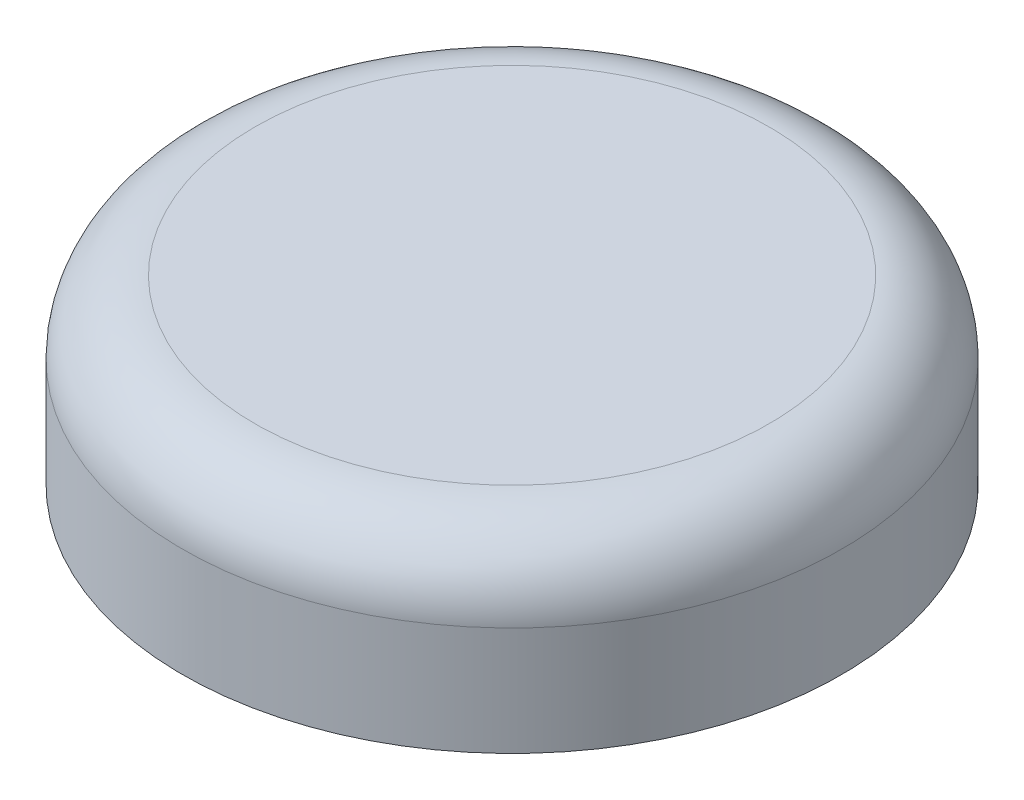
ISO-10303-21;
HEADER;
FILE_DESCRIPTION(('STEP AP214'),'2;1');
FILE_NAME('part.step','',(''),(''),'','','');
FILE_SCHEMA(('AUTOMOTIVE_DESIGN { 1 0 10303 214 1 1 1 1 }'));
ENDSEC;
DATA;
#1=APPLICATION_CONTEXT('core data for automotive mechanical design processes');
#2=APPLICATION_PROTOCOL_DEFINITION('international standard','automotive_design',2000,#1);
#3=PRODUCT_CONTEXT('',#1,'mechanical');
#4=PRODUCT('Part','Part','',(#3));
#5=PRODUCT_RELATED_PRODUCT_CATEGORY('part','',(#4));
#6=PRODUCT_DEFINITION_FORMATION('','',#4);
#7=PRODUCT_DEFINITION_CONTEXT('part definition',#1,'design');
#8=PRODUCT_DEFINITION('design','',#6,#7);
#9=PRODUCT_DEFINITION_SHAPE('','',#8);
#10=(LENGTH_UNIT() NAMED_UNIT(*) SI_UNIT(.MILLI.,.METRE.));
#11=(NAMED_UNIT(*) PLANE_ANGLE_UNIT() SI_UNIT($,.RADIAN.));
#12=(NAMED_UNIT(*) SI_UNIT($,.STERADIAN.) SOLID_ANGLE_UNIT());
#13=UNCERTAINTY_MEASURE_WITH_UNIT(LENGTH_MEASURE(1.E-05),#10,'distance_accuracy_value','');
#14=(GEOMETRIC_REPRESENTATION_CONTEXT(3) GLOBAL_UNCERTAINTY_ASSIGNED_CONTEXT((#13)) GLOBAL_UNIT_ASSIGNED_CONTEXT((#10,
#11,#12)) REPRESENTATION_CONTEXT('',''));
#15=CARTESIAN_POINT('',(0.,0.,0.));
#16=DIRECTION('',(0.,0.,1.));
#17=DIRECTION('',(1.,0.,0.));
#18=AXIS2_PLACEMENT_3D('',#15,#16,#17);
#19=CARTESIAN_POINT('',(-1.,-2.,0.));
#20=DIRECTION('',(0.,-1.,0.));
#21=DIRECTION('',(1.,0.,0.));
#22=AXIS2_PLACEMENT_3D('',#19,#20,#21);
#23=PLANE('',#22);
#24=CARTESIAN_POINT('',(0.,-2.,0.));
#25=DIRECTION('',(0.,1.,0.));
#26=DIRECTION('',(-1.,0.,0.));
#27=AXIS2_PLACEMENT_3D('',#24,#25,#26);
#28=CIRCLE('',#27,1.00000000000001);
#29=CARTESIAN_POINT('',(-1.,-2.,0.));
#30=VERTEX_POINT('',#29);
#31=EDGE_CURVE('E62',#30,#30,#28,.T.);
#32=ORIENTED_EDGE('',*,*,#31,.F.);
#33=EDGE_LOOP('',(#32));
#34=FACE_BOUND('',#33,.T.);
#35=ADVANCED_FACE('F31',(#34),#23,.T.);
#36=CARTESIAN_POINT('',(-7.10000000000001,5.,0.));
#37=DIRECTION('',(0.,1.,0.));
#38=DIRECTION('',(-1.,0.,0.));
#39=AXIS2_PLACEMENT_3D('',#36,#37,#38);
#40=PLANE('',#39);
#41=CARTESIAN_POINT('',(0.,5.00000000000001,0.));
#42=DIRECTION('',(0.,1.,0.));
#43=DIRECTION('',(-1.,0.,0.));
#44=AXIS2_PLACEMENT_3D('',#41,#42,#43);
#45=CIRCLE('',#44,7.1);
#46=CARTESIAN_POINT('',(-7.10000000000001,5.,0.));
#47=VERTEX_POINT('',#46);
#48=EDGE_CURVE('E10',#47,#47,#45,.T.);
#49=ORIENTED_EDGE('',*,*,#48,.T.);
#50=EDGE_LOOP('',(#49));
#51=FACE_BOUND('',#50,.T.);
#52=ADVANCED_FACE('F70',(#51),#40,.T.);
#53=CARTESIAN_POINT('',(0.,3.00000000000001,0.));
#54=DIRECTION('',(0.,1.,0.));
#55=DIRECTION('',(-1.,0.,0.));
#56=AXIS2_PLACEMENT_3D('',#53,#54,#55);
#57=TOROIDAL_SURFACE('',#56,7.10000000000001,2.);
#58=CARTESIAN_POINT('',(0.,3.00000000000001,0.));
#59=DIRECTION('',(0.,1.,0.));
#60=DIRECTION('',(-1.,0.,0.));
#61=AXIS2_PLACEMENT_3D('',#58,#59,#60);
#62=CIRCLE('',#61,9.1);
#63=CARTESIAN_POINT('',(-9.1,3.,0.));
#64=VERTEX_POINT('',#63);
#65=EDGE_CURVE('E37',#64,#64,#62,.T.);
#66=ORIENTED_EDGE('',*,*,#65,.T.);
#67=EDGE_LOOP('',(#66));
#68=FACE_BOUND('',#67,.T.);
#69=ORIENTED_EDGE('',*,*,#48,.F.);
#70=EDGE_LOOP('',(#69));
#71=FACE_BOUND('',#70,.T.);
#72=ADVANCED_FACE('F74',(#68,#71),#57,.T.);
#73=CARTESIAN_POINT('',(0.,5.,0.));
#74=DIRECTION('',(0.,1.,0.));
#75=DIRECTION('',(-1.,0.,0.));
#76=AXIS2_PLACEMENT_3D('',#73,#74,#75);
#77=CYLINDRICAL_SURFACE('',#76,9.1);
#78=CARTESIAN_POINT('',(0.,0.,0.));
#79=DIRECTION('',(0.,1.,0.));
#80=DIRECTION('',(-1.,0.,0.));
#81=AXIS2_PLACEMENT_3D('',#78,#79,#80);
#82=CIRCLE('',#81,9.10000000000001);
#83=CARTESIAN_POINT('',(-9.1,0.,0.));
#84=VERTEX_POINT('',#83);
#85=EDGE_CURVE('E41',#84,#84,#82,.T.);
#86=ORIENTED_EDGE('',*,*,#85,.T.);
#87=EDGE_LOOP('',(#86));
#88=FACE_BOUND('',#87,.T.);
#89=ORIENTED_EDGE('',*,*,#65,.F.);
#90=EDGE_LOOP('',(#89));
#91=FACE_BOUND('',#90,.T.);
#92=ADVANCED_FACE('F78',(#88,#91),#77,.T.);
#93=CARTESIAN_POINT('',(-8.1,0.,0.));
#94=DIRECTION('',(0.,-1.,0.));
#95=DIRECTION('',(1.,0.,0.));
#96=AXIS2_PLACEMENT_3D('',#93,#94,#95);
#97=PLANE('',#96);
#98=CARTESIAN_POINT('',(0.,0.,0.));
#99=DIRECTION('',(0.,1.,0.));
#100=DIRECTION('',(-1.,0.,0.));
#101=AXIS2_PLACEMENT_3D('',#98,#99,#100);
#102=CIRCLE('',#101,8.10000000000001);
#103=CARTESIAN_POINT('',(-8.1,0.,0.));
#104=VERTEX_POINT('',#103);
#105=EDGE_CURVE('E45',#104,#104,#102,.T.);
#106=ORIENTED_EDGE('',*,*,#105,.T.);
#107=EDGE_LOOP('',(#106));
#108=FACE_BOUND('',#107,.T.);
#109=ORIENTED_EDGE('',*,*,#85,.F.);
#110=EDGE_LOOP('',(#109));
#111=FACE_BOUND('',#110,.T.);
#112=ADVANCED_FACE('F83',(#108,#111),#97,.T.);
#113=CARTESIAN_POINT('',(0.,0.,0.));
#114=DIRECTION('',(0.,-1.,0.));
#115=DIRECTION('',(1.,0.,0.));
#116=AXIS2_PLACEMENT_3D('',#113,#114,#115);
#117=CONICAL_SURFACE('',#116,8.10000000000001,0.785398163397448);
#118=CARTESIAN_POINT('',(0.,1.00000000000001,0.));
#119=DIRECTION('',(0.,1.,0.));
#120=DIRECTION('',(-1.,0.,0.));
#121=AXIS2_PLACEMENT_3D('',#118,#119,#120);
#122=CIRCLE('',#121,7.10000000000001);
#123=CARTESIAN_POINT('',(-7.1,1.,0.));
#124=VERTEX_POINT('',#123);
#125=EDGE_CURVE('E50',#124,#124,#122,.T.);
#126=ORIENTED_EDGE('',*,*,#125,.T.);
#127=EDGE_LOOP('',(#126));
#128=FACE_BOUND('',#127,.T.);
#129=ORIENTED_EDGE('',*,*,#105,.F.);
#130=EDGE_LOOP('',(#129));
#131=FACE_BOUND('',#130,.T.);
#132=ADVANCED_FACE('F87',(#128,#131),#117,.F.);
#133=CARTESIAN_POINT('',(0.,5.,0.));
#134=DIRECTION('',(0.,1.,0.));
#135=DIRECTION('',(-1.,0.,0.));
#136=AXIS2_PLACEMENT_3D('',#133,#134,#135);
#137=CYLINDRICAL_SURFACE('',#136,7.10000000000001);
#138=CARTESIAN_POINT('',(0.,3.00000000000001,0.));
#139=DIRECTION('',(0.,1.,0.));
#140=DIRECTION('',(-1.,0.,0.));
#141=AXIS2_PLACEMENT_3D('',#138,#139,#140);
#142=CIRCLE('',#141,7.10000000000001);
#143=CARTESIAN_POINT('',(-7.10000000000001,3.,0.));
#144=VERTEX_POINT('',#143);
#145=EDGE_CURVE('E53',#144,#144,#142,.T.);
#146=ORIENTED_EDGE('',*,*,#145,.T.);
#147=EDGE_LOOP('',(#146));
#148=FACE_BOUND('',#147,.T.);
#149=ORIENTED_EDGE('',*,*,#125,.F.);
#150=EDGE_LOOP('',(#149));
#151=FACE_BOUND('',#150,.T.);
#152=ADVANCED_FACE('F91',(#148,#151),#137,.F.);
#153=CARTESIAN_POINT('',(-2.,3.00000000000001,0.));
#154=DIRECTION('',(0.,-1.,0.));
#155=DIRECTION('',(1.,0.,0.));
#156=AXIS2_PLACEMENT_3D('',#153,#154,#155);
#157=PLANE('',#156);
#158=CARTESIAN_POINT('',(0.,3.00000000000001,0.));
#159=DIRECTION('',(0.,1.,0.));
#160=DIRECTION('',(-1.,0.,0.));
#161=AXIS2_PLACEMENT_3D('',#158,#159,#160);
#162=CIRCLE('',#161,2.);
#163=CARTESIAN_POINT('',(-2.,3.,0.));
#164=VERTEX_POINT('',#163);
#165=EDGE_CURVE('E56',#164,#164,#162,.T.);
#166=ORIENTED_EDGE('',*,*,#165,.T.);
#167=EDGE_LOOP('',(#166));
#168=FACE_BOUND('',#167,.T.);
#169=ORIENTED_EDGE('',*,*,#145,.F.);
#170=EDGE_LOOP('',(#169));
#171=FACE_BOUND('',#170,.T.);
#172=ADVANCED_FACE('F95',(#168,#171),#157,.T.);
#173=CARTESIAN_POINT('',(0.,5.,0.));
#174=DIRECTION('',(0.,1.,0.));
#175=DIRECTION('',(-1.,0.,0.));
#176=AXIS2_PLACEMENT_3D('',#173,#174,#175);
#177=CYLINDRICAL_SURFACE('',#176,2.);
#178=CARTESIAN_POINT('',(0.,-0.999999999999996,0.));
#179=DIRECTION('',(0.,1.,0.));
#180=DIRECTION('',(-1.,0.,0.));
#181=AXIS2_PLACEMENT_3D('',#178,#179,#180);
#182=CIRCLE('',#181,2.00000000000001);
#183=CARTESIAN_POINT('',(-2.,-0.999999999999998,0.));
#184=VERTEX_POINT('',#183);
#185=EDGE_CURVE('E59',#184,#184,#182,.T.);
#186=ORIENTED_EDGE('',*,*,#185,.T.);
#187=EDGE_LOOP('',(#186));
#188=FACE_BOUND('',#187,.T.);
#189=ORIENTED_EDGE('',*,*,#165,.F.);
#190=EDGE_LOOP('',(#189));
#191=FACE_BOUND('',#190,.T.);
#192=ADVANCED_FACE('F99',(#188,#191),#177,.T.);
#193=CARTESIAN_POINT('',(0.,-0.999999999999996,0.));
#194=DIRECTION('',(0.,1.,0.));
#195=DIRECTION('',(-1.,0.,0.));
#196=AXIS2_PLACEMENT_3D('',#193,#194,#195);
#197=CONICAL_SURFACE('',#196,2.00000000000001,0.785398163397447);
#198=ORIENTED_EDGE('',*,*,#31,.T.);
#199=EDGE_LOOP('',(#198));
#200=FACE_BOUND('',#199,.T.);
#201=ORIENTED_EDGE('',*,*,#185,.F.);
#202=EDGE_LOOP('',(#201));
#203=FACE_BOUND('',#202,.T.);
#204=ADVANCED_FACE('F66',(#200,#203),#197,.T.);
#205=CLOSED_SHELL('',(#35,#52,#72,#92,#112,#132,#152,#172,#192,#204));
#206=MANIFOLD_SOLID_BREP('B2',#205);
#207=ADVANCED_BREP_SHAPE_REPRESENTATION('',(#18,#206),#14);
#208=SHAPE_DEFINITION_REPRESENTATION(#9,#207);
ENDSEC;
END-ISO-10303-21;
